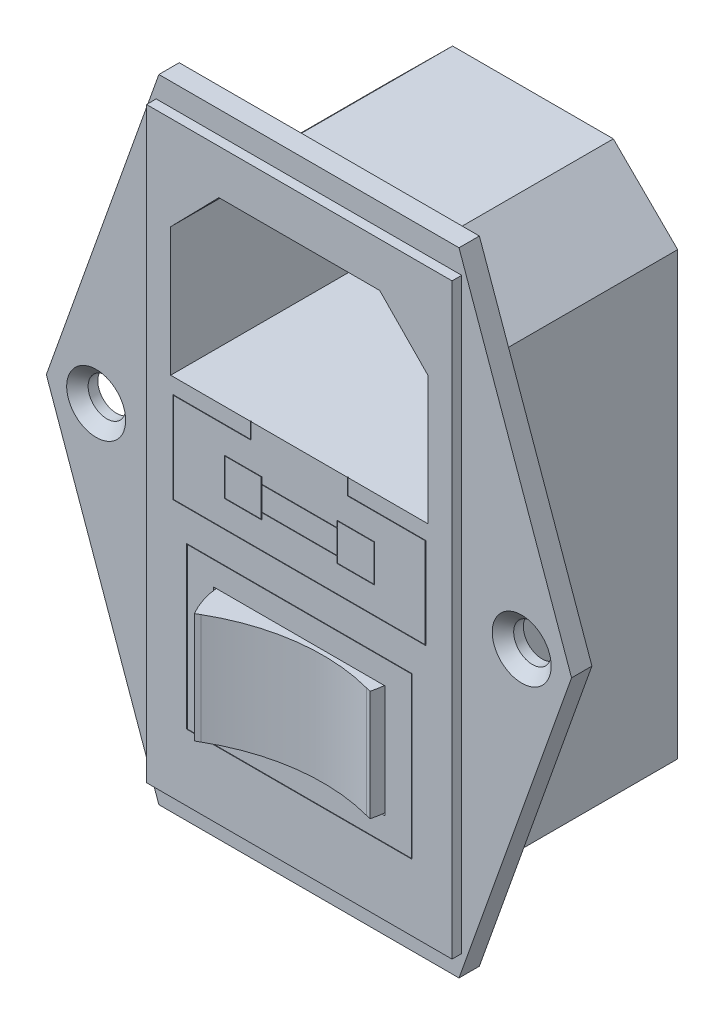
from build123d import *

# Parameters (mm, degrees)
SKETCH1_R           = 1.75
BOSS_EXTRUDE1_DEPTH = 1.9
SKETCH2_W           = 28.5
SKETCH2_H           = 54.8
BOSS_EXTRUDE2_DEPTH = 0.9
CHAMFER1_SIZE       = 1
BOSS_EXTRUDE3_DEPTH = 19
CUT_EXTRUDE1_DEPTH  = 18.3
SKETCH5_W           = 3.5
SKETCH5_H           = 3.5
SKETCH5_W_2         = 3.4
SKETCH5_H_2         = 3.4
SKETCH5_W_3         = 7
SKETCH5_H_3         = 0.05
SKETCH5_W_4         = 21
SKETCH5_H_4         = 15
SKETCH5_W_5         = 20.9
SKETCH5_H_5         = 14.9
CUT_EXTRUDE2_DEPTH  = 0.05
SKETCH6_W           = 24
SKETCH6_H           = 15.5
CUT_EXTRUDE3_DEPTH  = 19
CUT_EXTRUDE4_DEPTH  = 1.25
SKETCH8_W           = 20
SKETCH8_H           = 13
BOSS_EXTRUDE4_DEPTH = 14
SKETCH5_3_W         = 16
SKETCH5_3_H         = 10.5
CUT_EXTRUDE6_DEPTH  = 1
SKETCH10_W          = 7.9
SKETCH10_H          = 10.3
REVOLVE2_ANGLE      = 30
SKETCH10_6_W        = 7.9
SKETCH10_6_H        = 10.3
REVOLVE3_ANGLE      = 15
FILLET1_R           = 18


with BuildPart() as part:
    # Sketch1 → Boss-Extrude1 (new body)
    with BuildSketch(Plane.XY):
        Polygon((-24.5, 0), (-14, 29.5), (14, 29.5), (24.5, 0), (14, -29.5), (-14, -29.5), align=None)
        with Locations(Location((-19.85, 0, 0), (0, 0, 180))):
            Circle(SKETCH1_R, mode=Mode.SUBTRACT)
        with Locations(Location((19.85, 0, 0), (0, 0, 180))):
            Circle(SKETCH1_R, mode=Mode.SUBTRACT)
    extrude(amount=BOSS_EXTRUDE1_DEPTH)

    # Sketch2 → Boss-Extrude2 (add)
    with BuildSketch(Plane.XY.offset(1.9)):
        Rectangle(SKETCH2_W, SKETCH2_H)
    extrude(amount=BOSS_EXTRUDE2_DEPTH)

    # Chamfer1
    chamfer1_edges = [part.edges().sort_by_distance(p)[0] for p in [
        (-18.1, 0, 1.9),
        (21.6, 0, 1.9),
    ]]
    chamfer(chamfer1_edges, length=CHAMFER1_SIZE)

    # Sketch3 → Boss-Extrude3 (add)
    with BuildSketch(Plane(origin=(0, 0, 0), x_dir=(-1, 0, 0), z_dir=(0, 0, -1))):
        Polygon((7.5, 24.6), (-7.5, 24.6), (-13.5, 18.65), (-13.5, -22.5), (13.5, -22.5), (13.5, 18.65), align=None)
    extrude(amount=BOSS_EXTRUDE3_DEPTH)

    # Sketch4 → Cut-Extrude1 (cut)
    with BuildSketch(Plane.XY.offset(2.8)):
        Polygon((7.5, 23.25), (-7.5, 23.25), (-12, 18.65), (-12, 6.65), (12, 6.65), (12, 18.65), align=None)
    extrude(amount=-CUT_EXTRUDE1_DEPTH, mode=Mode.SUBTRACT)

    # Sketch5 → Cut-Extrude2 (cut)
    # profile 1 of 6: a face of its own
    with BuildSketch(Plane.XY.offset(2.8)):
        with Locations((-5.25, 0.95)):
            Rectangle(SKETCH5_W, SKETCH5_H)
        with Locations((-5.25, 0.95)):
            Rectangle(SKETCH5_W_2, SKETCH5_H_2, mode=Mode.SUBTRACT)
    # profile 2 of 6: a face of its own
    with BuildSketch(Plane.XY.offset(2.8)):
        Polygon((-3.5, 2.05), (0, 2.05), (3.5, 2.05), (3.5, 2.1), (0, 2.1), (-3.5, 2.1), align=None)
    # profile 3 of 6: a face of its own
    with BuildSketch(Plane.XY.offset(2.8)):
        with Locations((0, -0.175)):
            Rectangle(SKETCH5_W_3, SKETCH5_H_3)
    # profile 4 of 6: a face of its own
    with BuildSketch(Plane.XY.offset(2.8)):
        with Locations((5.25, 0.95)):
            Rectangle(SKETCH5_W, SKETCH5_H)
        with Locations((5.25, 0.95)):
            Rectangle(SKETCH5_W_2, SKETCH5_H_2, mode=Mode.SUBTRACT)
    # profile 5 of 6: a face of its own
    with BuildSketch(Plane.XY.offset(2.8)):
        with Locations((0, -13.7)):
            Rectangle(SKETCH5_W_4, SKETCH5_H_4)
        with Locations((0, -13.7)):
            Rectangle(SKETCH5_W_5, SKETCH5_H_5, mode=Mode.SUBTRACT)
    # profile 6 of 6: a face of its own
    with BuildSketch(Plane.XY.offset(2.8)):
        Polygon((-4.5, 6.65), (-4.5, 5.15), (-11.75, 5.15), (-11.75, -3.25), (11.75, -3.25), (11.75, 5.15), (4.5, 5.15), (4.5, 6.65), (4.55, 6.65), (4.55, 5.2), (11.8, 5.2), (11.8, -3.3), (-11.8, -3.3), (-11.8, 5.2), (-4.55, 5.2), (-4.55, 6.65), align=None)
    extrude(amount=-CUT_EXTRUDE2_DEPTH, mode=Mode.SUBTRACT)

    # Sketch6 → Cut-Extrude3 (cut)
    with BuildSketch(Plane(origin=(0, 0, -19), x_dir=(-1, 0, 0), z_dir=(0, 0, -1))):
        with Locations((0, -13.5)):
            Rectangle(SKETCH6_W, SKETCH6_H)
    extrude(amount=-CUT_EXTRUDE3_DEPTH, mode=Mode.SUBTRACT)

    # Sketch7 → Cut-Extrude4 (cut)
    with BuildSketch(Plane.XZ.offset(22.5)):
        Polygon((8.5, -19), (4.458548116, -12), (-4.458548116, -12), (-8.5, -19), align=None)
    extrude(amount=-CUT_EXTRUDE4_DEPTH, mode=Mode.SUBTRACT)

    # Sketch8 → Boss-Extrude4 (add)
    with BuildSketch(Plane(origin=(0, 0, 0), x_dir=(-1, 0, 0), z_dir=(0, 0, -1))):
        with Locations((0, -13.5)):
            Rectangle(SKETCH8_W, SKETCH8_H)
    extrude(amount=BOSS_EXTRUDE4_DEPTH)

    # Sketch5_3 → Cut-Extrude6 (cut)
    with BuildSketch(Plane.XY.offset(2.8)):
        with Locations((0, -13.7)):
            Rectangle(SKETCH5_3_W, SKETCH5_3_H)
    extrude(amount=-CUT_EXTRUDE6_DEPTH, mode=Mode.SUBTRACT)

    # Sketch10 → Revolve2 (revolve)
    with BuildSketch(Plane.XY.offset(1.8)):
        with Locations((-3.95, -13.7)):
            Rectangle(SKETCH10_W, SKETCH10_H)
    revolve(axis=Axis((0, -8.45, 1.8), (0, 1, 0)), revolution_arc=REVOLVE2_ANGLE)

    # Sketch10_6 → Revolve3 (revolve)
    with BuildSketch(Plane.XY.offset(1.8)):
        with Locations((3.95, -13.7)):
            Rectangle(SKETCH10_6_W, SKETCH10_6_H)
    revolve(axis=Axis((0, -8.45, 1.8), (0, -1, 0)), revolution_arc=REVOLVE3_ANGLE)

    # Fillet1
    fillet1_edges = [part.edges().sort_by_distance(p)[0] for p in [
        (0, -13.7, 1.8),
    ]]
    fillet(fillet1_edges, radius=FILLET1_R)


solid = part.part
